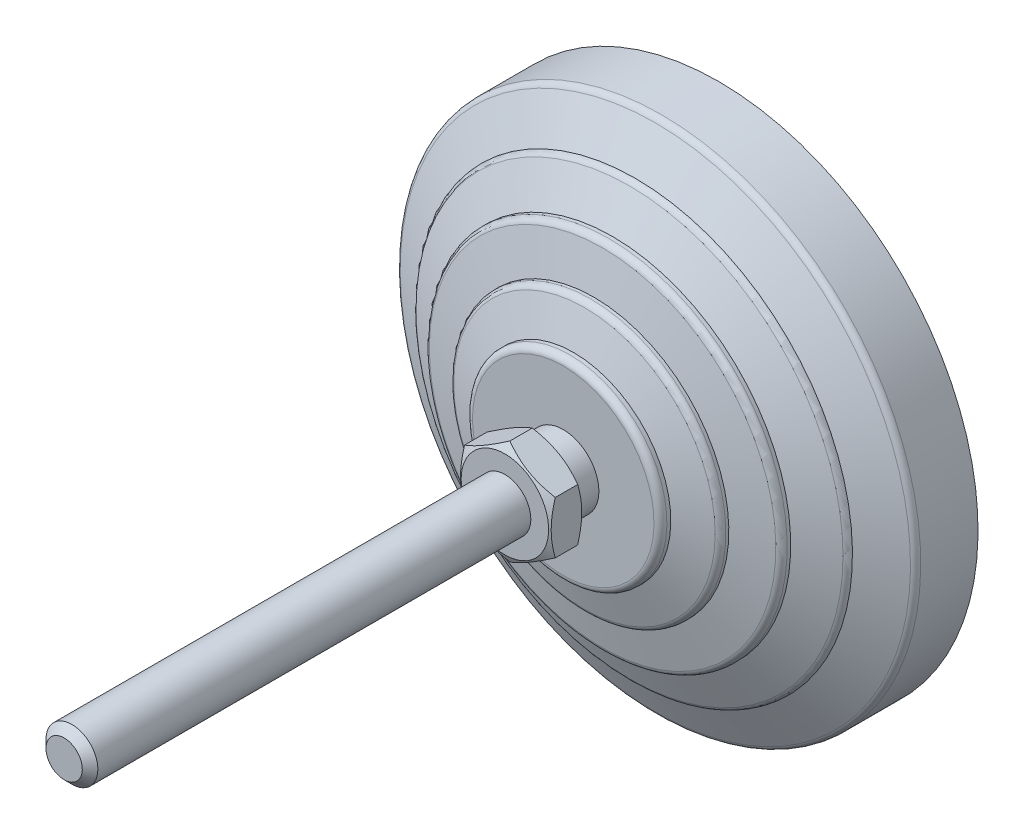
ISO-10303-21;
HEADER;
FILE_DESCRIPTION(('STEP AP214'),'2;1');
FILE_NAME('part.step','',(''),(''),'','','');
FILE_SCHEMA(('AUTOMOTIVE_DESIGN { 1 0 10303 214 1 1 1 1 }'));
ENDSEC;
DATA;
#1=APPLICATION_CONTEXT('core data for automotive mechanical design processes');
#2=APPLICATION_PROTOCOL_DEFINITION('international standard','automotive_design',2000,#1);
#3=PRODUCT_CONTEXT('',#1,'mechanical');
#4=PRODUCT('Part','Part','',(#3));
#5=PRODUCT_RELATED_PRODUCT_CATEGORY('part','',(#4));
#6=PRODUCT_DEFINITION_FORMATION('','',#4);
#7=PRODUCT_DEFINITION_CONTEXT('part definition',#1,'design');
#8=PRODUCT_DEFINITION('design','',#6,#7);
#9=PRODUCT_DEFINITION_SHAPE('','',#8);
#10=(LENGTH_UNIT() NAMED_UNIT(*) SI_UNIT(.MILLI.,.METRE.));
#11=(NAMED_UNIT(*) PLANE_ANGLE_UNIT() SI_UNIT($,.RADIAN.));
#12=(NAMED_UNIT(*) SI_UNIT($,.STERADIAN.) SOLID_ANGLE_UNIT());
#13=UNCERTAINTY_MEASURE_WITH_UNIT(LENGTH_MEASURE(1.E-05),#10,'distance_accuracy_value','');
#14=(GEOMETRIC_REPRESENTATION_CONTEXT(3) GLOBAL_UNCERTAINTY_ASSIGNED_CONTEXT((#13)) GLOBAL_UNIT_ASSIGNED_CONTEXT((#10,
#11,#12)) REPRESENTATION_CONTEXT('',''));
#15=CARTESIAN_POINT('',(0.,0.,0.));
#16=DIRECTION('',(0.,0.,1.));
#17=DIRECTION('',(1.,0.,0.));
#18=AXIS2_PLACEMENT_3D('',#15,#16,#17);
#19=CARTESIAN_POINT('',(-5.49999999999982,0.,28.));
#20=DIRECTION('',(0.,0.,1.));
#21=DIRECTION('',(0.,-1.,0.));
#22=AXIS2_PLACEMENT_3D('',#19,#20,#21);
#23=PLANE('',#22);
#24=CARTESIAN_POINT('',(0.,0.,28.));
#25=DIRECTION('',(0.,0.,-1.));
#26=DIRECTION('',(-1.,0.,0.));
#27=AXIS2_PLACEMENT_3D('',#24,#25,#26);
#28=CIRCLE('',#27,6.75);
#29=CARTESIAN_POINT('',(-6.75,0.,28.));
#30=VERTEX_POINT('',#29);
#31=EDGE_CURVE('E531',#30,#30,#28,.T.);
#32=ORIENTED_EDGE('',*,*,#31,.T.);
#33=EDGE_LOOP('',(#32));
#34=FACE_BOUND('',#33,.T.);
#35=CARTESIAN_POINT('',(0.,0.,28.));
#36=DIRECTION('',(0.,0.,-1.));
#37=DIRECTION('',(0.,1.,0.));
#38=AXIS2_PLACEMENT_3D('',#35,#36,#37);
#39=CIRCLE('',#38,5.49999999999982);
#40=CARTESIAN_POINT('',(0.,5.49999999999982,28.));
#41=VERTEX_POINT('',#40);
#42=EDGE_CURVE('E141',#41,#41,#39,.T.);
#43=ORIENTED_EDGE('',*,*,#42,.F.);
#44=EDGE_LOOP('',(#43));
#45=FACE_BOUND('',#44,.T.);
#46=ADVANCED_FACE('F14',(#34,#45),#23,.F.);
#47=CARTESIAN_POINT('',(0.,0.,0.));
#48=DIRECTION('',(0.,0.,-1.));
#49=DIRECTION('',(0.,1.,0.));
#50=AXIS2_PLACEMENT_3D('',#47,#48,#49);
#51=CYLINDRICAL_SURFACE('',#50,5.49999999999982);
#52=CARTESIAN_POINT('',(0.,0.,24.));
#53=DIRECTION('',(0.,0.,-1.));
#54=DIRECTION('',(0.,1.,0.));
#55=AXIS2_PLACEMENT_3D('',#52,#53,#54);
#56=CIRCLE('',#55,5.49999999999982);
#57=CARTESIAN_POINT('',(0.,5.49999999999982,24.));
#58=VERTEX_POINT('',#57);
#59=EDGE_CURVE('E138',#58,#58,#56,.T.);
#60=ORIENTED_EDGE('',*,*,#59,.F.);
#61=EDGE_LOOP('',(#60));
#62=FACE_BOUND('',#61,.T.);
#63=ORIENTED_EDGE('',*,*,#42,.T.);
#64=EDGE_LOOP('',(#63));
#65=FACE_BOUND('',#64,.T.);
#66=ADVANCED_FACE('F165',(#62,#65),#51,.T.);
#67=CARTESIAN_POINT('',(-5.49999999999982,0.,24.));
#68=DIRECTION('',(0.,0.,-1.));
#69=DIRECTION('',(0.,1.,0.));
#70=AXIS2_PLACEMENT_3D('',#67,#68,#69);
#71=PLANE('',#70);
#72=CARTESIAN_POINT('',(0.,0.,24.));
#73=DIRECTION('',(0.,0.,-1.));
#74=DIRECTION('',(0.,1.,0.));
#75=AXIS2_PLACEMENT_3D('',#72,#73,#74);
#76=CIRCLE('',#75,14.);
#77=CARTESIAN_POINT('',(0.,14.,24.));
#78=VERTEX_POINT('',#77);
#79=EDGE_CURVE('E135',#78,#78,#76,.T.);
#80=ORIENTED_EDGE('',*,*,#79,.F.);
#81=EDGE_LOOP('',(#80));
#82=FACE_BOUND('',#81,.T.);
#83=ORIENTED_EDGE('',*,*,#59,.T.);
#84=EDGE_LOOP('',(#83));
#85=FACE_BOUND('',#84,.T.);
#86=ADVANCED_FACE('F172',(#82,#85),#71,.F.);
#87=CARTESIAN_POINT('',(0.,0.,23.));
#88=DIRECTION('',(0.,0.,-1.));
#89=DIRECTION('',(0.,1.,0.));
#90=AXIS2_PLACEMENT_3D('',#87,#88,#89);
#91=TOROIDAL_SURFACE('',#90,14.,1.);
#92=CARTESIAN_POINT('',(0.,0.,23.));
#93=DIRECTION('',(0.,0.,-1.));
#94=DIRECTION('',(0.,1.,0.));
#95=AXIS2_PLACEMENT_3D('',#92,#93,#94);
#96=CIRCLE('',#95,15.);
#97=CARTESIAN_POINT('',(0.,15.,23.));
#98=VERTEX_POINT('',#97);
#99=EDGE_CURVE('E132',#98,#98,#96,.T.);
#100=ORIENTED_EDGE('',*,*,#99,.F.);
#101=EDGE_LOOP('',(#100));
#102=FACE_BOUND('',#101,.T.);
#103=ORIENTED_EDGE('',*,*,#79,.T.);
#104=EDGE_LOOP('',(#103));
#105=FACE_BOUND('',#104,.T.);
#106=ADVANCED_FACE('F394',(#102,#105),#91,.T.);
#107=CARTESIAN_POINT('',(0.,0.,0.));
#108=DIRECTION('',(0.,0.,-1.));
#109=DIRECTION('',(0.,1.,0.));
#110=AXIS2_PLACEMENT_3D('',#107,#108,#109);
#111=CYLINDRICAL_SURFACE('',#110,15.);
#112=CARTESIAN_POINT('',(0.,0.,22.4025287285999));
#113=DIRECTION('',(0.,0.,-1.));
#114=DIRECTION('',(0.,1.,0.));
#115=AXIS2_PLACEMENT_3D('',#112,#113,#114);
#116=CIRCLE('',#115,15.);
#117=CARTESIAN_POINT('',(0.,15.,22.4025287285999));
#118=VERTEX_POINT('',#117);
#119=EDGE_CURVE('E129',#118,#118,#116,.T.);
#120=ORIENTED_EDGE('',*,*,#119,.F.);
#121=EDGE_LOOP('',(#120));
#122=FACE_BOUND('',#121,.T.);
#123=ORIENTED_EDGE('',*,*,#99,.T.);
#124=EDGE_LOOP('',(#123));
#125=FACE_BOUND('',#124,.T.);
#126=ADVANCED_FACE('F384',(#122,#125),#111,.T.);
#127=CARTESIAN_POINT('',(0.,0.,22.4025287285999));
#128=DIRECTION('',(0.,0.,-1.));
#129=DIRECTION('',(0.,1.,0.));
#130=AXIS2_PLACEMENT_3D('',#127,#128,#129);
#131=CONICAL_SURFACE('',#130,15.,1.25589726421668);
#132=CARTESIAN_POINT('',(0.,0.,20.7216684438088));
#133=DIRECTION('',(0.,0.,-1.));
#134=DIRECTION('',(0.,1.,0.));
#135=AXIS2_PLACEMENT_3D('',#132,#133,#134);
#136=CIRCLE('',#135,20.16016354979);
#137=CARTESIAN_POINT('',(0.,20.16016354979,20.7216684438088));
#138=VERTEX_POINT('',#137);
#139=EDGE_CURVE('E126',#138,#138,#136,.T.);
#140=ORIENTED_EDGE('',*,*,#139,.F.);
#141=EDGE_LOOP('',(#140));
#142=FACE_BOUND('',#141,.T.);
#143=ORIENTED_EDGE('',*,*,#119,.T.);
#144=EDGE_LOOP('',(#143));
#145=FACE_BOUND('',#144,.T.);
#146=ADVANCED_FACE('F374',(#142,#145),#131,.T.);
#147=CARTESIAN_POINT('',(0.,0.,19.7708407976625));
#148=DIRECTION('',(0.,0.,-1.));
#149=DIRECTION('',(0.,1.,0.));
#150=AXIS2_PLACEMENT_3D('',#147,#148,#149);
#151=TOROIDAL_SURFACE('',#150,19.8504430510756,1.);
#152=CARTESIAN_POINT('',(0.,0.,19.7708407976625));
#153=DIRECTION('',(0.,0.,-1.));
#154=DIRECTION('',(0.,1.,0.));
#155=AXIS2_PLACEMENT_3D('',#152,#153,#154);
#156=CIRCLE('',#155,20.8504430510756);
#157=CARTESIAN_POINT('',(0.,20.8504430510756,19.7708407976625));
#158=VERTEX_POINT('',#157);
#159=EDGE_CURVE('E123',#158,#158,#156,.T.);
#160=ORIENTED_EDGE('',*,*,#159,.F.);
#161=EDGE_LOOP('',(#160));
#162=FACE_BOUND('',#161,.T.);
#163=ORIENTED_EDGE('',*,*,#139,.T.);
#164=EDGE_LOOP('',(#163));
#165=FACE_BOUND('',#164,.T.);
#166=ADVANCED_FACE('F364',(#162,#165),#151,.T.);
#167=CARTESIAN_POINT('',(0.,0.,0.));
#168=DIRECTION('',(0.,0.,-1.));
#169=DIRECTION('',(0.,1.,0.));
#170=AXIS2_PLACEMENT_3D('',#167,#168,#169);
#171=CYLINDRICAL_SURFACE('',#170,20.8504430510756);
#172=CARTESIAN_POINT('',(0.,0.,19.2987385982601));
#173=DIRECTION('',(0.,0.,-1.));
#174=DIRECTION('',(0.,1.,0.));
#175=AXIS2_PLACEMENT_3D('',#172,#173,#174);
#176=CIRCLE('',#175,20.8504430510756);
#177=CARTESIAN_POINT('',(0.,20.8504430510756,19.2987385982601));
#178=VERTEX_POINT('',#177);
#179=EDGE_CURVE('E120',#178,#178,#176,.T.);
#180=ORIENTED_EDGE('',*,*,#179,.F.);
#181=EDGE_LOOP('',(#180));
#182=FACE_BOUND('',#181,.T.);
#183=ORIENTED_EDGE('',*,*,#159,.T.);
#184=EDGE_LOOP('',(#183));
#185=FACE_BOUND('',#184,.T.);
#186=ADVANCED_FACE('F354',(#182,#185),#171,.T.);
#187=CARTESIAN_POINT('',(0.,0.,19.2987385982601));
#188=DIRECTION('',(0.,0.,-1.));
#189=DIRECTION('',(0.,1.,0.));
#190=AXIS2_PLACEMENT_3D('',#187,#188,#189);
#191=CONICAL_SURFACE('',#190,20.8504430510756,1.34067144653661);
#192=CARTESIAN_POINT('',(0.,0.,17.9217501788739));
#193=DIRECTION('',(0.,0.,-1.));
#194=DIRECTION('',(0.,1.,0.));
#195=AXIS2_PLACEMENT_3D('',#192,#193,#194);
#196=CIRCLE('',#195,26.728099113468);
#197=CARTESIAN_POINT('',(0.,26.728099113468,17.9217501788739));
#198=VERTEX_POINT('',#197);
#199=EDGE_CURVE('E117',#198,#198,#196,.T.);
#200=ORIENTED_EDGE('',*,*,#199,.F.);
#201=EDGE_LOOP('',(#200));
#202=FACE_BOUND('',#201,.T.);
#203=ORIENTED_EDGE('',*,*,#179,.T.);
#204=EDGE_LOOP('',(#203));
#205=FACE_BOUND('',#204,.T.);
#206=ADVANCED_FACE('F344',(#202,#205),#191,.T.);
#207=CARTESIAN_POINT('',(0.,0.,16.9481122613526));
#208=DIRECTION('',(0.,0.,-1.));
#209=DIRECTION('',(0.,1.,0.));
#210=AXIS2_PLACEMENT_3D('',#207,#208,#209);
#211=TOROIDAL_SURFACE('',#210,26.5,1.);
#212=CARTESIAN_POINT('',(0.,0.,16.9481122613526));
#213=DIRECTION('',(0.,0.,-1.));
#214=DIRECTION('',(0.,1.,0.));
#215=AXIS2_PLACEMENT_3D('',#212,#213,#214);
#216=CIRCLE('',#215,27.5);
#217=CARTESIAN_POINT('',(0.,27.5,16.9481122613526));
#218=VERTEX_POINT('',#217);
#219=EDGE_CURVE('E114',#218,#218,#216,.T.);
#220=ORIENTED_EDGE('',*,*,#219,.F.);
#221=EDGE_LOOP('',(#220));
#222=FACE_BOUND('',#221,.T.);
#223=ORIENTED_EDGE('',*,*,#199,.T.);
#224=EDGE_LOOP('',(#223));
#225=FACE_BOUND('',#224,.T.);
#226=ADVANCED_FACE('F334',(#222,#225),#211,.T.);
#227=CARTESIAN_POINT('',(0.,0.,0.));
#228=DIRECTION('',(0.,0.,-1.));
#229=DIRECTION('',(0.,1.,0.));
#230=AXIS2_PLACEMENT_3D('',#227,#228,#229);
#231=CYLINDRICAL_SURFACE('',#230,27.5);
#232=CARTESIAN_POINT('',(0.,0.,16.4025287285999));
#233=DIRECTION('',(0.,0.,-1.));
#234=DIRECTION('',(0.,1.,0.));
#235=AXIS2_PLACEMENT_3D('',#232,#233,#234);
#236=CIRCLE('',#235,27.5);
#237=CARTESIAN_POINT('',(0.,27.5,16.4025287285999));
#238=VERTEX_POINT('',#237);
#239=EDGE_CURVE('E111',#238,#238,#236,.T.);
#240=ORIENTED_EDGE('',*,*,#239,.F.);
#241=EDGE_LOOP('',(#240));
#242=FACE_BOUND('',#241,.T.);
#243=ORIENTED_EDGE('',*,*,#219,.T.);
#244=EDGE_LOOP('',(#243));
#245=FACE_BOUND('',#244,.T.);
#246=ADVANCED_FACE('F324',(#242,#245),#231,.T.);
#247=CARTESIAN_POINT('',(0.,0.,16.4025287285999));
#248=DIRECTION('',(0.,0.,-1.));
#249=DIRECTION('',(0.,1.,0.));
#250=AXIS2_PLACEMENT_3D('',#247,#248,#249);
#251=CONICAL_SURFACE('',#250,27.5,1.12022914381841);
#252=CARTESIAN_POINT('',(0.,0.,13.7730910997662));
#253=DIRECTION('',(0.,0.,-1.));
#254=DIRECTION('',(0.,1.,0.));
#255=AXIS2_PLACEMENT_3D('',#252,#253,#254);
#256=CIRCLE('',#255,32.935476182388);
#257=CARTESIAN_POINT('',(0.,32.935476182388,13.7730910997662));
#258=VERTEX_POINT('',#257);
#259=EDGE_CURVE('E108',#258,#258,#256,.T.);
#260=ORIENTED_EDGE('',*,*,#259,.F.);
#261=EDGE_LOOP('',(#260));
#262=FACE_BOUND('',#261,.T.);
#263=ORIENTED_EDGE('',*,*,#239,.T.);
#264=EDGE_LOOP('',(#263));
#265=FACE_BOUND('',#264,.T.);
#266=ADVANCED_FACE('F314',(#262,#265),#251,.T.);
#267=CARTESIAN_POINT('',(0.,0.,12.872890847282));
#268=DIRECTION('',(0.,0.,-1.));
#269=DIRECTION('',(0.,1.,0.));
#270=AXIS2_PLACEMENT_3D('',#267,#268,#269);
#271=TOROIDAL_SURFACE('',#270,32.5,1.);
#272=CARTESIAN_POINT('',(0.,0.,12.872890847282));
#273=DIRECTION('',(0.,0.,-1.));
#274=DIRECTION('',(0.,1.,0.));
#275=AXIS2_PLACEMENT_3D('',#272,#273,#274);
#276=CIRCLE('',#275,33.5);
#277=CARTESIAN_POINT('',(0.,33.5,12.872890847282));
#278=VERTEX_POINT('',#277);
#279=EDGE_CURVE('E105',#278,#278,#276,.T.);
#280=ORIENTED_EDGE('',*,*,#279,.F.);
#281=EDGE_LOOP('',(#280));
#282=FACE_BOUND('',#281,.T.);
#283=ORIENTED_EDGE('',*,*,#259,.T.);
#284=EDGE_LOOP('',(#283));
#285=FACE_BOUND('',#284,.T.);
#286=ADVANCED_FACE('F304',(#282,#285),#271,.T.);
#287=CARTESIAN_POINT('',(0.,0.,12.872890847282));
#288=DIRECTION('',(0.,0.,-1.));
#289=DIRECTION('',(0.,1.,0.));
#290=AXIS2_PLACEMENT_3D('',#287,#288,#289);
#291=CONICAL_SURFACE('',#290,33.5,1.08482699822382);
#292=CARTESIAN_POINT('',(0.,0.,9.7780502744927));
#293=DIRECTION('',(0.,0.,-1.));
#294=DIRECTION('',(0.,1.,0.));
#295=AXIS2_PLACEMENT_3D('',#292,#293,#294);
#296=CIRCLE('',#295,39.358979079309);
#297=CARTESIAN_POINT('',(0.,39.358979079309,9.7780502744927));
#298=VERTEX_POINT('',#297);
#299=EDGE_CURVE('E102',#298,#298,#296,.T.);
#300=ORIENTED_EDGE('',*,*,#299,.F.);
#301=EDGE_LOOP('',(#300));
#302=FACE_BOUND('',#301,.T.);
#303=ORIENTED_EDGE('',*,*,#279,.T.);
#304=EDGE_LOOP('',(#303));
#305=FACE_BOUND('',#304,.T.);
#306=ADVANCED_FACE('F294',(#302,#305),#291,.T.);
#307=CARTESIAN_POINT('',(0.,0.,8.84470466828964));
#308=DIRECTION('',(0.,0.,-1.));
#309=DIRECTION('',(0.,1.,0.));
#310=AXIS2_PLACEMENT_3D('',#307,#308,#309);
#311=TOROIDAL_SURFACE('',#310,39.,1.);
#312=CARTESIAN_POINT('',(0.,0.,8.84470466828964));
#313=DIRECTION('',(0.,0.,-1.));
#314=DIRECTION('',(0.,1.,0.));
#315=AXIS2_PLACEMENT_3D('',#312,#313,#314);
#316=CIRCLE('',#315,40.);
#317=CARTESIAN_POINT('',(0.,40.,8.84470466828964));
#318=VERTEX_POINT('',#317);
#319=EDGE_CURVE('E99',#318,#318,#316,.T.);
#320=ORIENTED_EDGE('',*,*,#319,.F.);
#321=EDGE_LOOP('',(#320));
#322=FACE_BOUND('',#321,.T.);
#323=ORIENTED_EDGE('',*,*,#299,.T.);
#324=EDGE_LOOP('',(#323));
#325=FACE_BOUND('',#324,.T.);
#326=ADVANCED_FACE('F284',(#322,#325),#311,.T.);
#327=CARTESIAN_POINT('',(0.,0.,0.));
#328=DIRECTION('',(0.,0.,-1.));
#329=DIRECTION('',(0.,1.,0.));
#330=AXIS2_PLACEMENT_3D('',#327,#328,#329);
#331=CYLINDRICAL_SURFACE('',#330,40.);
#332=CARTESIAN_POINT('',(0.,0.,0.));
#333=DIRECTION('',(0.,0.,-1.));
#334=DIRECTION('',(0.,1.,0.));
#335=AXIS2_PLACEMENT_3D('',#332,#333,#334);
#336=CIRCLE('',#335,40.);
#337=CARTESIAN_POINT('',(0.,40.,0.));
#338=VERTEX_POINT('',#337);
#339=EDGE_CURVE('E96',#338,#338,#336,.T.);
#340=ORIENTED_EDGE('',*,*,#339,.F.);
#341=EDGE_LOOP('',(#340));
#342=FACE_BOUND('',#341,.T.);
#343=ORIENTED_EDGE('',*,*,#319,.T.);
#344=EDGE_LOOP('',(#343));
#345=FACE_BOUND('',#344,.T.);
#346=ADVANCED_FACE('F273',(#342,#345),#331,.T.);
#347=CARTESIAN_POINT('',(0.,0.,0.));
#348=DIRECTION('',(0.,0.,1.));
#349=DIRECTION('',(0.,-1.,0.));
#350=AXIS2_PLACEMENT_3D('',#347,#348,#349);
#351=PLANE('',#350);
#352=ORIENTED_EDGE('',*,*,#339,.T.);
#353=EDGE_LOOP('',(#352));
#354=FACE_BOUND('',#353,.T.);
#355=ADVANCED_FACE('F163',(#354),#351,.F.);
#356=CARTESIAN_POINT('',(0.,0.,29.5002734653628));
#357=DIRECTION('',(0.,0.,1.));
#358=DIRECTION('',(1.,0.,0.));
#359=AXIS2_PLACEMENT_3D('',#356,#357,#358);
#360=CONICAL_SURFACE('',#359,9.3485498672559,1.0471975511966);
#361=CARTESIAN_POINT('',(0.000200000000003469,-8.0830192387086,28.7696190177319));
#362=CARTESIAN_POINT('',(-0.15366790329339,-7.99418356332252,28.7183374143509));
#363=CARTESIAN_POINT('',(-0.308109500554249,-7.90501666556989,28.669383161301));
#364=CARTESIAN_POINT('',(-0.618246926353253,-7.72595873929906,28.5767703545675));
#365=CARTESIAN_POINT('',(-0.773943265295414,-7.63606741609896,28.5331140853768));
#366=CARTESIAN_POINT('',(-1.24352516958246,-7.36495417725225,28.4109491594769));
#367=CARTESIAN_POINT('',(-1.5592643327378,-7.18266208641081,28.3414631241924));
#368=CARTESIAN_POINT('',(-2.03176224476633,-6.90986528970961,28.2599825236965));
#369=CARTESIAN_POINT('',(-2.18710922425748,-6.82017566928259,28.2367710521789));
#370=CARTESIAN_POINT('',(-2.49850511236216,-6.64039116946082,28.1978487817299));
#371=CARTESIAN_POINT('',(-2.6545539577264,-6.55029632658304,28.1821373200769));
#372=CARTESIAN_POINT('',(-2.96692267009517,-6.36995016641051,28.1586154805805));
#373=CARTESIAN_POINT('',(-3.12324202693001,-6.27969914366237,28.1507961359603));
#374=CARTESIAN_POINT('',(-3.43601650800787,-6.09911871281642,28.1432178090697));
#375=CARTESIAN_POINT('',(-3.59247162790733,-6.00878930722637,28.1434585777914));
#376=CARTESIAN_POINT('',(-4.02110687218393,-5.76131663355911,28.155197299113));
#377=CARTESIAN_POINT('',(-4.29314668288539,-5.60425437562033,28.1749033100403));
#378=CARTESIAN_POINT('',(-4.83541944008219,-5.29117305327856,28.2373910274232));
#379=CARTESIAN_POINT('',(-5.10565047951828,-5.13515508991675,28.2801940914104));
#380=CARTESIAN_POINT('',(-5.64901454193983,-4.82144370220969,28.3871892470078));
#381=CARTESIAN_POINT('',(-5.92207900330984,-4.6637898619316,28.4518346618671));
#382=CARTESIAN_POINT('',(-6.46413578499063,-4.35083323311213,28.5985536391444));
#383=CARTESIAN_POINT('',(-6.73313504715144,-4.19552643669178,28.680592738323));
#384=CARTESIAN_POINT('',(-7.0002,-4.04133641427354,28.7696190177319));
#385=B_SPLINE_CURVE_WITH_KNOTS('',3,(#361,#362,#363,#364,#365,#366,#367,#368,#369,#370,#371,
#372,#373,#374,#375,#376,#377,#378,#379,#380,#381,#382,#383,#384),.UNSPECIFIED.,.F.,.F.,(4,2,2,
2,2,2,2,2,2,2,2,4),(0.,0.554727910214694,1.10969417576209,2.2219327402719,2.76443041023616,
3.30688013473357,3.84871284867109,4.39052882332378,5.33376515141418,6.27787517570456,
7.2429241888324,8.20607866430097),.UNSPECIFIED.);
#386=CARTESIAN_POINT('',(0.,-8.08290376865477,28.7695523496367));
#387=VERTEX_POINT('',#386);
#388=CARTESIAN_POINT('',(-7.,-4.04145188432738,28.7695523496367));
#389=VERTEX_POINT('',#388);
#390=EDGE_CURVE('E73',#387,#389,#385,.T.);
#391=ORIENTED_EDGE('',*,*,#390,.T.);
#392=CARTESIAN_POINT('',(-7.,-10.8000725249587,31.5334883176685));
#393=CARTESIAN_POINT('',(-7.,-10.4947981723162,31.3856279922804));
#394=CARTESIAN_POINT('',(-7.,-10.1888170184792,31.2392016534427));
#395=CARTESIAN_POINT('',(-7.,-9.57506499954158,30.9500246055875));
#396=CARTESIAN_POINT('',(-7.,-9.26729385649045,30.8072744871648));
#397=CARTESIAN_POINT('',(-7.,-8.6479731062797,30.525527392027));
#398=CARTESIAN_POINT('',(-7.,-8.33641201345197,30.3865555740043));
#399=CARTESIAN_POINT('',(-7.,-7.7107921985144,30.1143742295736));
#400=CARTESIAN_POINT('',(-7.,-7.39673359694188,29.9811644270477));
#401=CARTESIAN_POINT('',(-7.,-6.7557024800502,29.7179585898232));
#402=CARTESIAN_POINT('',(-7.,-6.42863408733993,29.5881947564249));
#403=CARTESIAN_POINT('',(-7.,-5.77065108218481,29.3386238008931));
#404=CARTESIAN_POINT('',(-7.,-5.4397360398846,29.2188178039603));
#405=CARTESIAN_POINT('',(-7.,-4.77416687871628,28.9923489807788));
#406=CARTESIAN_POINT('',(-7.,-4.43952208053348,28.8856590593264));
#407=CARTESIAN_POINT('',(-7.,-3.765444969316,28.6888810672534));
#408=CARTESIAN_POINT('',(-7.,-3.42601421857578,28.5987877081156));
#409=CARTESIAN_POINT('',(-7.,-2.74398709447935,28.4400448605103));
#410=CARTESIAN_POINT('',(-7.,-2.40141801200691,28.3712813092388));
#411=CARTESIAN_POINT('',(-7.,-1.88448997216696,28.2871384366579));
#412=CARTESIAN_POINT('',(-7.,-1.7116551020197,28.2622567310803));
#413=CARTESIAN_POINT('',(-7.,-1.36514538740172,28.2193167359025));
#414=CARTESIAN_POINT('',(-7.,-1.19147062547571,28.2012577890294));
#415=CARTESIAN_POINT('',(-7.,-0.845758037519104,28.1725467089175));
#416=CARTESIAN_POINT('',(-7.,-0.673727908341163,28.161802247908));
#417=CARTESIAN_POINT('',(-7.,-0.329367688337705,28.1475938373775));
#418=CARTESIAN_POINT('',(-7.,-0.157037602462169,28.1441297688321));
#419=CARTESIAN_POINT('',(-7.,0.187615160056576,28.1445646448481));
#420=CARTESIAN_POINT('',(-7.,0.35993783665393,28.1484636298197));
#421=CARTESIAN_POINT('',(-7.,0.704267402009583,28.163530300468));
#422=CARTESIAN_POINT('',(-7.,0.876274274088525,28.1746983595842));
#423=CARTESIAN_POINT('',(-7.,1.29136456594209,28.2101860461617));
#424=CARTESIAN_POINT('',(-7.,1.5341512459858,28.2380492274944));
#425=CARTESIAN_POINT('',(-7.,2.01787436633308,28.3067245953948));
#426=CARTESIAN_POINT('',(-7.,2.25881054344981,28.3475385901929));
#427=CARTESIAN_POINT('',(-7.,2.97859497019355,28.4872384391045));
#428=CARTESIAN_POINT('',(-7.,3.4541404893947,28.6033552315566));
#429=CARTESIAN_POINT('',(-7.,4.16513621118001,28.8041034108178));
#430=CARTESIAN_POINT('',(-7.,4.40428948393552,28.8763686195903));
#431=CARTESIAN_POINT('',(-7.,4.88027219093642,29.0282529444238));
#432=CARTESIAN_POINT('',(-7.,5.1171016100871,29.1078721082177));
#433=CARTESIAN_POINT('',(-7.,5.58851407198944,29.2731995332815));
#434=CARTESIAN_POINT('',(-7.,5.82309786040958,29.3589056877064));
#435=CARTESIAN_POINT('',(-7.,6.29033210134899,29.5354138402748));
#436=CARTESIAN_POINT('',(-7.,6.52298257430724,29.6262157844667));
#437=CARTESIAN_POINT('',(-7.,7.0628659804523,29.842655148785));
#438=CARTESIAN_POINT('',(-7.,7.36944444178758,29.9699218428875));
#439=CARTESIAN_POINT('',(-7.,7.98007301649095,30.2303994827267));
#440=CARTESIAN_POINT('',(-7.,8.28412298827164,30.3636107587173));
#441=CARTESIAN_POINT('',(-7.,8.89014777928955,30.6348092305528));
#442=CARTESIAN_POINT('',(-7.,9.19212220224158,30.7727973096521));
#443=CARTESIAN_POINT('',(-7.,9.79428929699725,31.0526145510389));
#444=CARTESIAN_POINT('',(-7.,10.0944819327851,31.1944437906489));
#445=CARTESIAN_POINT('',(-7.,10.6936664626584,31.4813784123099));
#446=CARTESIAN_POINT('',(-7.,10.9926568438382,31.6264869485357));
#447=CARTESIAN_POINT('',(-7.,11.5893671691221,31.9192953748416));
#448=CARTESIAN_POINT('',(-7.,11.8870871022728,32.0669952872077));
#449=CARTESIAN_POINT('',(-7.,12.7785655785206,32.5132694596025));
#450=CARTESIAN_POINT('',(-7.,13.3707169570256,32.8150539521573));
#451=CARTESIAN_POINT('',(-7.,14.5038839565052,33.3999081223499));
#452=CARTESIAN_POINT('',(-7.,15.0451443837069,33.6825055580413));
#453=CARTESIAN_POINT('',(-7.,16.1256470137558,34.2515723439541));
#454=CARTESIAN_POINT('',(-7.,16.6648891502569,34.5380418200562));
#455=CARTESIAN_POINT('',(-7.,17.7405205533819,35.1132591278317));
#456=CARTESIAN_POINT('',(-7.,18.2769135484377,35.4019999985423));
#457=CARTESIAN_POINT('',(-7.,19.3484037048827,35.9818105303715));
#458=CARTESIAN_POINT('',(-7.,19.883500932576,36.2728800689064));
#459=CARTESIAN_POINT('',(-7.,20.4181185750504,36.5648219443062));
#460=B_SPLINE_CURVE_WITH_KNOTS('',3,(#392,#393,#394,#395,#396,#397,#398,#399,#400,#401,#402,
#403,#404,#405,#406,#407,#408,#409,#410,#411,#412,#413,#414,#415,#416,#417,#418,#419,#420,#421,
#422,#423,#424,#425,#426,#427,#428,#429,#430,#431,#432,#433,#434,#435,#436,#437,#438,#439,#440,
#441,#442,#443,#444,#445,#446,#447,#448,#449,#450,#451,#452,#453,#454,#455,#456,#457,#458,#459),
.UNSPECIFIED.,.F.,.F.,(4,2,2,2,2,2,2,2,2,2,2,2,2,2,2,2,2,2,2,2,2,2,2,2,2,2,2,2,2,2,2,2,2,4),(0.,
1.01760591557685,2.0353743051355,3.05877828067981,4.08213315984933,5.13761691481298,
6.19321977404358,7.24660395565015,8.29965189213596,9.34696742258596,9.8707040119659,
10.3943901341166,10.9113369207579,11.4282752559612,11.9452164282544,12.462184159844,
13.1949098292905,13.9277378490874,15.3942299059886,16.1436684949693,16.8931119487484,
17.6422972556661,18.3914746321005,19.3872246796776,20.3830301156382,21.3790206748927,
22.3750312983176,23.3720445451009,24.3690663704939,26.362863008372,28.1946261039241,
30.0264488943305,31.8539543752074,33.6813642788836),.UNSPECIFIED.);
#461=CARTESIAN_POINT('',(-7.,4.04145188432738,28.7695523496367));
#462=VERTEX_POINT('',#461);
#463=EDGE_CURVE('E81',#389,#462,#460,.T.);
#464=ORIENTED_EDGE('',*,*,#463,.T.);
#465=CARTESIAN_POINT('',(-7.0002,4.04133641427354,28.7696190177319));
#466=CARTESIAN_POINT('',(-6.84633209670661,4.13017208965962,28.7183374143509));
#467=CARTESIAN_POINT('',(-6.69189049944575,4.21933898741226,28.669383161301));
#468=CARTESIAN_POINT('',(-6.38175307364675,4.39839691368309,28.5767703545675));
#469=CARTESIAN_POINT('',(-6.22605673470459,4.48828823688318,28.5331140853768));
#470=CARTESIAN_POINT('',(-5.75647483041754,4.75940147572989,28.4109491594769));
#471=CARTESIAN_POINT('',(-5.4407356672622,4.94169356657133,28.3414631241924));
#472=CARTESIAN_POINT('',(-4.96823775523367,5.21449036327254,28.2599825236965));
#473=CARTESIAN_POINT('',(-4.81289077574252,5.30417998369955,28.2367710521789));
#474=CARTESIAN_POINT('',(-4.50149488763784,5.48396448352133,28.1978487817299));
#475=CARTESIAN_POINT('',(-4.34544604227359,5.57405932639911,28.1821373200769));
#476=CARTESIAN_POINT('',(-4.03307732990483,5.75440548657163,28.1586154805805));
#477=CARTESIAN_POINT('',(-3.87675797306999,5.84465650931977,28.1507961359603));
#478=CARTESIAN_POINT('',(-3.56398349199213,6.02523694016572,28.1432178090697));
#479=CARTESIAN_POINT('',(-3.40752837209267,6.11556634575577,28.1434585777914));
#480=CARTESIAN_POINT('',(-2.97889312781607,6.36303901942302,28.155197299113));
#481=CARTESIAN_POINT('',(-2.7068533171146,6.52010127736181,28.1749033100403));
#482=CARTESIAN_POINT('',(-2.16458055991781,6.83318259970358,28.2373910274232));
#483=CARTESIAN_POINT('',(-1.89434952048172,6.9892005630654,28.2801940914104));
#484=CARTESIAN_POINT('',(-1.35098545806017,7.30291195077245,28.3871892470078));
#485=CARTESIAN_POINT('',(-1.07792099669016,7.46056579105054,28.4518346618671));
#486=CARTESIAN_POINT('',(-0.535864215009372,7.77352241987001,28.5985536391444));
#487=CARTESIAN_POINT('',(-0.266864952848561,7.92882921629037,28.680592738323));
#488=CARTESIAN_POINT('',(0.000199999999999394,8.0830192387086,28.7696190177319));
#489=B_SPLINE_CURVE_WITH_KNOTS('',3,(#465,#466,#467,#468,#469,#470,#471,#472,#473,#474,#475,
#476,#477,#478,#479,#480,#481,#482,#483,#484,#485,#486,#487,#488),.UNSPECIFIED.,.F.,.F.,(4,2,2,
2,2,2,2,2,2,2,2,4),(0.,0.554727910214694,1.10969417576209,2.2219327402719,2.76443041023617,
3.30688013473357,3.84871284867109,4.39052882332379,5.33376515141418,6.27787517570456,
7.2429241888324,8.20607866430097),.UNSPECIFIED.);
#490=CARTESIAN_POINT('',(0.,8.08290376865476,28.7695523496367));
#491=VERTEX_POINT('',#490);
#492=EDGE_CURVE('E486',#462,#491,#489,.T.);
#493=ORIENTED_EDGE('',*,*,#492,.T.);
#494=CARTESIAN_POINT('',(-0.000200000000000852,8.0830192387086,28.7696190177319));
#495=CARTESIAN_POINT('',(0.15366790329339,7.99418356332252,28.7183374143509));
#496=CARTESIAN_POINT('',(0.308109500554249,7.90501666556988,28.669383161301));
#497=CARTESIAN_POINT('',(0.618246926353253,7.72595873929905,28.5767703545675));
#498=CARTESIAN_POINT('',(0.773943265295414,7.63606741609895,28.5331140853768));
#499=CARTESIAN_POINT('',(1.24352516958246,7.36495417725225,28.4109491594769));
#500=CARTESIAN_POINT('',(1.5592643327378,7.18266208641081,28.3414631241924));
#501=CARTESIAN_POINT('',(2.03176224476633,6.9098652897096,28.2599825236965));
#502=CARTESIAN_POINT('',(2.18710922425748,6.82017566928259,28.2367710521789));
#503=CARTESIAN_POINT('',(2.49850511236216,6.64039116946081,28.1978487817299));
#504=CARTESIAN_POINT('',(2.65455395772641,6.55029632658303,28.1821373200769));
#505=CARTESIAN_POINT('',(2.96692267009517,6.36995016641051,28.1586154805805));
#506=CARTESIAN_POINT('',(3.12324202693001,6.27969914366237,28.1507961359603));
#507=CARTESIAN_POINT('',(3.43601650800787,6.09911871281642,28.1432178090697));
#508=CARTESIAN_POINT('',(3.59247162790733,6.00878930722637,28.1434585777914));
#509=CARTESIAN_POINT('',(4.02110687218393,5.76131663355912,28.155197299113));
#510=CARTESIAN_POINT('',(4.2931466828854,5.60425437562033,28.1749033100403));
#511=CARTESIAN_POINT('',(4.83541944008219,5.29117305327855,28.2373910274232));
#512=CARTESIAN_POINT('',(5.10565047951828,5.13515508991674,28.2801940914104));
#513=CARTESIAN_POINT('',(5.64901454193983,4.82144370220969,28.3871892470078));
#514=CARTESIAN_POINT('',(5.92207900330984,4.66378986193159,28.4518346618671));
#515=CARTESIAN_POINT('',(6.46413578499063,4.35083323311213,28.5985536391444));
#516=CARTESIAN_POINT('',(6.73313504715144,4.19552643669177,28.680592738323));
#517=CARTESIAN_POINT('',(7.0002,4.04133641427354,28.7696190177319));
#518=B_SPLINE_CURVE_WITH_KNOTS('',3,(#494,#495,#496,#497,#498,#499,#500,#501,#502,#503,#504,
#505,#506,#507,#508,#509,#510,#511,#512,#513,#514,#515,#516,#517),.UNSPECIFIED.,.F.,.F.,(4,2,2,
2,2,2,2,2,2,2,2,4),(0.,0.554727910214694,1.10969417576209,2.2219327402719,2.76443041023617,
3.30688013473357,3.8487128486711,4.39052882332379,5.33376515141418,6.27787517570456,
7.2429241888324,8.20607866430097),.UNSPECIFIED.);
#519=CARTESIAN_POINT('',(7.,4.04145188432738,28.7695523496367));
#520=VERTEX_POINT('',#519);
#521=EDGE_CURVE('E481',#491,#520,#518,.T.);
#522=ORIENTED_EDGE('',*,*,#521,.T.);
#523=CARTESIAN_POINT('',(7.,-10.8000725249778,31.5334883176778));
#524=CARTESIAN_POINT('',(7.,-10.4947981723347,31.3856279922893));
#525=CARTESIAN_POINT('',(7.,-10.1888170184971,31.2392016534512));
#526=CARTESIAN_POINT('',(7.,-9.57506499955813,30.9500246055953));
#527=CARTESIAN_POINT('',(7.,-9.26729385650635,30.8072744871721));
#528=CARTESIAN_POINT('',(7.,-8.6479731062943,30.5255273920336));
#529=CARTESIAN_POINT('',(7.,-8.33641201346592,30.3865555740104));
#530=CARTESIAN_POINT('',(7.,-7.71079219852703,30.114374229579));
#531=CARTESIAN_POINT('',(7.,-7.39673359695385,29.9811644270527));
#532=CARTESIAN_POINT('',(7.,-6.7557024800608,29.7179585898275));
#533=CARTESIAN_POINT('',(7.,-6.42863408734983,29.5881947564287));
#534=CARTESIAN_POINT('',(7.,-5.77065108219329,29.3386238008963));
#535=CARTESIAN_POINT('',(7.,-5.43973603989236,29.218817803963));
#536=CARTESIAN_POINT('',(7.,-4.77416687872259,28.9923489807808));
#537=CARTESIAN_POINT('',(7.,-4.43952208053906,28.8856590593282));
#538=CARTESIAN_POINT('',(7.,-3.76544496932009,28.6888810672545));
#539=CARTESIAN_POINT('',(7.,-3.42601421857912,28.5987877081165));
#540=CARTESIAN_POINT('',(7.,-2.74398709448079,28.4400448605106));
#541=CARTESIAN_POINT('',(7.,-2.40141801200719,28.3712813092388));
#542=CARTESIAN_POINT('',(7.,-1.8844899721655,28.2871384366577));
#543=CARTESIAN_POINT('',(7.,-1.71165510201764,28.26225673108));
#544=CARTESIAN_POINT('',(7.,-1.36514538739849,28.2193167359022));
#545=CARTESIAN_POINT('',(7.,-1.19147062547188,28.201257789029));
#546=CARTESIAN_POINT('',(7.,-0.845758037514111,28.1725467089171));
#547=CARTESIAN_POINT('',(7.,-0.673727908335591,28.1618022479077));
#548=CARTESIAN_POINT('',(7.,-0.329367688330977,28.1475938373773));
#549=CARTESIAN_POINT('',(7.,-0.157037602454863,28.144129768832));
#550=CARTESIAN_POINT('',(7.,0.187615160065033,28.1445646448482));
#551=CARTESIAN_POINT('',(7.,0.359937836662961,28.14846362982));
#552=CARTESIAN_POINT('',(7.,0.704267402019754,28.1635303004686));
#553=CARTESIAN_POINT('',(7.,0.87627427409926,28.174698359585));
#554=CARTESIAN_POINT('',(7.,1.29136456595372,28.2101860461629));
#555=CARTESIAN_POINT('',(7.,1.53415124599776,28.2380492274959));
#556=CARTESIAN_POINT('',(7.,2.01787436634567,28.3067245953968));
#557=CARTESIAN_POINT('',(7.,2.25881054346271,28.3475385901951));
#558=CARTESIAN_POINT('',(7.,2.97859497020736,28.4872384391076));
#559=CARTESIAN_POINT('',(7.,3.45414048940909,28.6033552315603));
#560=CARTESIAN_POINT('',(7.,4.16513621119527,28.8041034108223));
#561=CARTESIAN_POINT('',(7.,4.40428948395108,28.8763686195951));
#562=CARTESIAN_POINT('',(7.,4.88027219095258,29.0282529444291));
#563=CARTESIAN_POINT('',(7.,5.11710161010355,29.1078721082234));
#564=CARTESIAN_POINT('',(7.,5.58851407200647,29.2731995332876));
#565=CARTESIAN_POINT('',(7.,5.82309786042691,29.3589056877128));
#566=CARTESIAN_POINT('',(7.,6.2903321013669,29.5354138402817));
#567=CARTESIAN_POINT('',(7.,6.52298257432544,29.6262157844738));
#568=CARTESIAN_POINT('',(7.,7.0628659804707,29.8426551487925));
#569=CARTESIAN_POINT('',(7.,7.3694444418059,29.9699218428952));
#570=CARTESIAN_POINT('',(7.,7.98007301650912,30.2303994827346));
#571=CARTESIAN_POINT('',(7.,8.28412298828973,30.3636107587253));
#572=CARTESIAN_POINT('',(7.,8.8901477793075,30.6348092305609));
#573=CARTESIAN_POINT('',(7.,9.19212220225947,30.7727973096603));
#574=CARTESIAN_POINT('',(7.,9.79428929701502,31.0526145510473));
#575=CARTESIAN_POINT('',(7.,10.0944819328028,31.1944437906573));
#576=CARTESIAN_POINT('',(7.,10.6936664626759,31.4813784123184));
#577=CARTESIAN_POINT('',(7.,10.9926568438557,31.6264869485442));
#578=CARTESIAN_POINT('',(7.,11.5893671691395,31.9192953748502));
#579=CARTESIAN_POINT('',(7.,11.8870871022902,32.0669952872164));
#580=CARTESIAN_POINT('',(7.,12.7785655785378,32.5132694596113));
#581=CARTESIAN_POINT('',(7.,13.3707169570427,32.8150539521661));
#582=CARTESIAN_POINT('',(7.,14.5038839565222,33.3999081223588));
#583=CARTESIAN_POINT('',(7.,15.0451443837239,33.6825055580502));
#584=CARTESIAN_POINT('',(7.,16.1256470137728,34.2515723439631));
#585=CARTESIAN_POINT('',(7.,16.6648891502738,34.5380418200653));
#586=CARTESIAN_POINT('',(7.,17.7405205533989,35.1132591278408));
#587=CARTESIAN_POINT('',(7.,18.2769135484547,35.4019999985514));
#588=CARTESIAN_POINT('',(7.,19.3484037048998,35.9818105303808));
#589=CARTESIAN_POINT('',(7.,19.883500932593,36.2728800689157));
#590=CARTESIAN_POINT('',(7.,20.4181185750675,36.5648219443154));
#591=B_SPLINE_CURVE_WITH_KNOTS('',3,(#523,#524,#525,#526,#527,#528,#529,#530,#531,#532,#533,
#534,#535,#536,#537,#538,#539,#540,#541,#542,#543,#544,#545,#546,#547,#548,#549,#550,#551,#552,
#553,#554,#555,#556,#557,#558,#559,#560,#561,#562,#563,#564,#565,#566,#567,#568,#569,#570,#571,
#572,#573,#574,#575,#576,#577,#578,#579,#580,#581,#582,#583,#584,#585,#586,#587,#588,#589,#590),
.UNSPECIFIED.,.F.,.F.,(4,2,2,2,2,2,2,2,2,2,2,2,2,2,2,2,2,2,2,2,2,2,2,2,2,2,2,2,2,2,2,2,2,4),(0.,
1.0176059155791,2.03537430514,3.05877828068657,4.08213315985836,5.13761691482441,
6.19321977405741,7.24660395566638,8.29965189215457,9.34696742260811,9.87070401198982,
10.3943901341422,10.9113369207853,11.4282752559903,11.9452164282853,12.4621841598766,
13.1949098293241,13.9277378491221,15.3942299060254,16.1436684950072,16.8931119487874,
17.6422972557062,18.3914746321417,19.3872246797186,20.3830301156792,21.3790206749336,
22.3750312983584,23.3720445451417,24.3690663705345,26.3628630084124,28.1946261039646,
30.026448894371,31.853954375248,33.6813642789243),.UNSPECIFIED.);
#592=CARTESIAN_POINT('',(7.,-4.04145188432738,28.7695523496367));
#593=VERTEX_POINT('',#592);
#594=EDGE_CURVE('E34',#520,#593,#591,.F.);
#595=ORIENTED_EDGE('',*,*,#594,.T.);
#596=CARTESIAN_POINT('',(7.0002,-4.04133641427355,28.7696190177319));
#597=CARTESIAN_POINT('',(6.84633209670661,-4.13017208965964,28.7183374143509));
#598=CARTESIAN_POINT('',(6.69189049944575,-4.21933898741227,28.669383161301));
#599=CARTESIAN_POINT('',(6.38175307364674,-4.3983969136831,28.5767703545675));
#600=CARTESIAN_POINT('',(6.22605673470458,-4.4882882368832,28.5331140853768));
#601=CARTESIAN_POINT('',(5.75647483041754,-4.7594014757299,28.4109491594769));
#602=CARTESIAN_POINT('',(5.4407356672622,-4.94169356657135,28.3414631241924));
#603=CARTESIAN_POINT('',(4.96823775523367,-5.21449036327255,28.2599825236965));
#604=CARTESIAN_POINT('',(4.81289077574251,-5.30417998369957,28.2367710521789));
#605=CARTESIAN_POINT('',(4.50149488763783,-5.48396448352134,28.1978487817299));
#606=CARTESIAN_POINT('',(4.34544604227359,-5.57405932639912,28.1821373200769));
#607=CARTESIAN_POINT('',(4.03307732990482,-5.75440548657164,28.1586154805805));
#608=CARTESIAN_POINT('',(3.87675797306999,-5.84465650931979,28.1507961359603));
#609=CARTESIAN_POINT('',(3.56398349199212,-6.02523694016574,28.1432178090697));
#610=CARTESIAN_POINT('',(3.40752837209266,-6.11556634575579,28.1434585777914));
#611=CARTESIAN_POINT('',(2.97889312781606,-6.36303901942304,28.155197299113));
#612=CARTESIAN_POINT('',(2.7068533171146,-6.52010127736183,28.1749033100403));
#613=CARTESIAN_POINT('',(2.1645805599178,-6.8331825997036,28.2373910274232));
#614=CARTESIAN_POINT('',(1.89434952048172,-6.98920056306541,28.2801940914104));
#615=CARTESIAN_POINT('',(1.35098545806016,-7.30291195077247,28.3871892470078));
#616=CARTESIAN_POINT('',(1.07792099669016,-7.46056579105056,28.4518346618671));
#617=CARTESIAN_POINT('',(0.535864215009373,-7.77352241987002,28.5985536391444));
#618=CARTESIAN_POINT('',(0.266864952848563,-7.92882921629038,28.680592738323));
#619=CARTESIAN_POINT('',(-0.000199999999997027,-8.08301923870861,28.7696190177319));
#620=B_SPLINE_CURVE_WITH_KNOTS('',3,(#596,#597,#598,#599,#600,#601,#602,#603,#604,#605,#606,
#607,#608,#609,#610,#611,#612,#613,#614,#615,#616,#617,#618,#619),.UNSPECIFIED.,.F.,.F.,(4,2,2,
2,2,2,2,2,2,2,2,4),(0.,0.554727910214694,1.10969417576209,2.2219327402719,2.76443041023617,
3.30688013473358,3.8487128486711,4.39052882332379,5.33376515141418,6.27787517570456,
7.24292418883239,8.20607866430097),.UNSPECIFIED.);
#621=EDGE_CURVE('E9',#593,#387,#620,.T.);
#622=ORIENTED_EDGE('',*,*,#621,.T.);
#623=EDGE_LOOP('',(#391,#464,#493,#522,#595,#622));
#624=FACE_BOUND('',#623,.T.);
#625=ORIENTED_EDGE('',*,*,#31,.F.);
#626=EDGE_LOOP('',(#625));
#627=FACE_BOUND('',#626,.T.);
#628=ADVANCED_FACE('F71',(#624,#627),#360,.T.);
#629=CARTESIAN_POINT('',(-2.79999999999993,0.,101.));
#630=DIRECTION('',(0.,0.,-1.));
#631=DIRECTION('',(0.,1.,0.));
#632=AXIS2_PLACEMENT_3D('',#629,#630,#631);
#633=PLANE('',#632);
#634=CARTESIAN_POINT('',(0.,0.,101.));
#635=DIRECTION('',(0.,0.,-1.));
#636=DIRECTION('',(0.,1.,0.));
#637=AXIS2_PLACEMENT_3D('',#634,#635,#636);
#638=CIRCLE('',#637,2.79999999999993);
#639=CARTESIAN_POINT('',(0.,2.79999999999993,101.));
#640=VERTEX_POINT('',#639);
#641=EDGE_CURVE('E28',#640,#640,#638,.T.);
#642=ORIENTED_EDGE('',*,*,#641,.F.);
#643=EDGE_LOOP('',(#642));
#644=FACE_BOUND('',#643,.T.);
#645=ADVANCED_FACE('F16',(#644),#633,.F.);
#646=CARTESIAN_POINT('',(0.,0.,101.));
#647=DIRECTION('',(0.,0.,-1.));
#648=DIRECTION('',(0.,1.,0.));
#649=AXIS2_PLACEMENT_3D('',#646,#647,#648);
#650=CONICAL_SURFACE('',#649,2.79999999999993,0.785398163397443);
#651=CARTESIAN_POINT('',(0.,0.,99.8));
#652=DIRECTION('',(0.,0.,-1.));
#653=DIRECTION('',(0.,1.,0.));
#654=AXIS2_PLACEMENT_3D('',#651,#652,#653);
#655=CIRCLE('',#654,3.99999999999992);
#656=CARTESIAN_POINT('',(0.,3.99999999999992,99.8));
#657=VERTEX_POINT('',#656);
#658=EDGE_CURVE('E147',#657,#657,#655,.T.);
#659=ORIENTED_EDGE('',*,*,#658,.F.);
#660=EDGE_LOOP('',(#659));
#661=FACE_BOUND('',#660,.T.);
#662=ORIENTED_EDGE('',*,*,#641,.T.);
#663=EDGE_LOOP('',(#662));
#664=FACE_BOUND('',#663,.T.);
#665=ADVANCED_FACE('F152',(#661,#664),#650,.T.);
#666=CARTESIAN_POINT('',(0.,0.,0.));
#667=DIRECTION('',(0.,0.,-1.));
#668=DIRECTION('',(0.,1.,0.));
#669=AXIS2_PLACEMENT_3D('',#666,#667,#668);
#670=CYLINDRICAL_SURFACE('',#669,3.99999999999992);
#671=CARTESIAN_POINT('',(0.,0.,33.));
#672=DIRECTION('',(0.,0.,-1.));
#673=DIRECTION('',(0.,1.,0.));
#674=AXIS2_PLACEMENT_3D('',#671,#672,#673);
#675=CIRCLE('',#674,3.99999999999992);
#676=CARTESIAN_POINT('',(0.,3.99999999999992,33.));
#677=VERTEX_POINT('',#676);
#678=EDGE_CURVE('E144',#677,#677,#675,.T.);
#679=ORIENTED_EDGE('',*,*,#678,.F.);
#680=EDGE_LOOP('',(#679));
#681=FACE_BOUND('',#680,.T.);
#682=ORIENTED_EDGE('',*,*,#658,.T.);
#683=EDGE_LOOP('',(#682));
#684=FACE_BOUND('',#683,.T.);
#685=ADVANCED_FACE('F161',(#681,#684),#670,.T.);
#686=CARTESIAN_POINT('',(-3.99999999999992,0.,33.));
#687=DIRECTION('',(0.,0.,-1.));
#688=DIRECTION('',(0.,1.,0.));
#689=AXIS2_PLACEMENT_3D('',#686,#687,#688);
#690=PLANE('',#689);
#691=CARTESIAN_POINT('',(0.,0.,33.));
#692=DIRECTION('',(0.,0.,-1.));
#693=DIRECTION('',(-1.,0.,0.));
#694=AXIS2_PLACEMENT_3D('',#691,#692,#693);
#695=CIRCLE('',#694,6.75);
#696=CARTESIAN_POINT('',(-6.75,0.,33.));
#697=VERTEX_POINT('',#696);
#698=EDGE_CURVE('E80',#697,#697,#695,.T.);
#699=ORIENTED_EDGE('',*,*,#698,.F.);
#700=EDGE_LOOP('',(#699));
#701=FACE_BOUND('',#700,.T.);
#702=ORIENTED_EDGE('',*,*,#678,.T.);
#703=EDGE_LOOP('',(#702));
#704=FACE_BOUND('',#703,.T.);
#705=ADVANCED_FACE('F179',(#701,#704),#690,.F.);
#706=CARTESIAN_POINT('',(0.,0.,33.));
#707=DIRECTION('',(0.,0.,-1.));
#708=DIRECTION('',(-1.,0.,0.));
#709=AXIS2_PLACEMENT_3D('',#706,#707,#708);
#710=CONICAL_SURFACE('',#709,6.75,1.0471975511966);
#711=CARTESIAN_POINT('',(-7.0002,-4.04133641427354,32.2303809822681));
#712=CARTESIAN_POINT('',(-6.84633209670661,-4.13017208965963,32.2816625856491));
#713=CARTESIAN_POINT('',(-6.69189049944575,-4.21933898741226,32.330616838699));
#714=CARTESIAN_POINT('',(-6.38175307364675,-4.39839691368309,32.4232296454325));
#715=CARTESIAN_POINT('',(-6.22605673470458,-4.48828823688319,32.4668859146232));
#716=CARTESIAN_POINT('',(-5.75647483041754,-4.75940147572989,32.5890508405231));
#717=CARTESIAN_POINT('',(-5.4407356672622,-4.94169356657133,32.6585368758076));
#718=CARTESIAN_POINT('',(-4.96823775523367,-5.21449036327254,32.7400174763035));
#719=CARTESIAN_POINT('',(-4.81289077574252,-5.30417998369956,32.7632289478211));
#720=CARTESIAN_POINT('',(-4.50149488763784,-5.48396448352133,32.8021512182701));
#721=CARTESIAN_POINT('',(-4.3454460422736,-5.57405932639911,32.8178626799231));
#722=CARTESIAN_POINT('',(-4.03307732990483,-5.75440548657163,32.8413845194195));
#723=CARTESIAN_POINT('',(-3.87675797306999,-5.84465650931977,32.8492038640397));
#724=CARTESIAN_POINT('',(-3.56398349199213,-6.02523694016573,32.8567821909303));
#725=CARTESIAN_POINT('',(-3.40752837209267,-6.11556634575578,32.8565414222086));
#726=CARTESIAN_POINT('',(-2.97889312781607,-6.36303901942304,32.844802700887));
#727=CARTESIAN_POINT('',(-2.70685331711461,-6.52010127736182,32.8250966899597));
#728=CARTESIAN_POINT('',(-2.16458055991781,-6.83318259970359,32.7626089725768));
#729=CARTESIAN_POINT('',(-1.89434952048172,-6.9892005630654,32.7198059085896));
#730=CARTESIAN_POINT('',(-1.35098545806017,-7.30291195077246,32.6128107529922));
#731=CARTESIAN_POINT('',(-1.07792099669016,-7.46056579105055,32.5481653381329));
#732=CARTESIAN_POINT('',(-0.535864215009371,-7.77352241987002,32.4014463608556));
#733=CARTESIAN_POINT('',(-0.266864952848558,-7.92882921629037,32.319407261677));
#734=CARTESIAN_POINT('',(0.000200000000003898,-8.0830192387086,32.2303809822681));
#735=B_SPLINE_CURVE_WITH_KNOTS('',3,(#711,#712,#713,#714,#715,#716,#717,#718,#719,#720,#721,
#722,#723,#724,#725,#726,#727,#728,#729,#730,#731,#732,#733,#734),.UNSPECIFIED.,.F.,.F.,(4,2,2,
2,2,2,2,2,2,2,2,4),(0.,0.554727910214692,1.10969417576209,2.22193274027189,2.76443041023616,
3.30688013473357,3.84871284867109,4.39052882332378,5.33376515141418,6.27787517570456,
7.2429241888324,8.20607866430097),.UNSPECIFIED.);
#736=CARTESIAN_POINT('',(-7.,-4.04145188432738,32.2304476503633));
#737=VERTEX_POINT('',#736);
#738=CARTESIAN_POINT('',(0.,-8.08290376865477,32.2304476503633));
#739=VERTEX_POINT('',#738);
#740=EDGE_CURVE('E88',#737,#739,#735,.T.);
#741=ORIENTED_EDGE('',*,*,#740,.T.);
#742=CARTESIAN_POINT('',(-0.000199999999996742,-8.08301923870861,32.2303809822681));
#743=CARTESIAN_POINT('',(0.153667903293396,-7.99418356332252,32.2816625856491));
#744=CARTESIAN_POINT('',(0.308109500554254,-7.90501666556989,32.330616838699));
#745=CARTESIAN_POINT('',(0.618246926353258,-7.72595873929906,32.4232296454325));
#746=CARTESIAN_POINT('',(0.773943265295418,-7.63606741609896,32.4668859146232));
#747=CARTESIAN_POINT('',(1.24352516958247,-7.36495417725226,32.5890508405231));
#748=CARTESIAN_POINT('',(1.5592643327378,-7.18266208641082,32.6585368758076));
#749=CARTESIAN_POINT('',(2.03176224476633,-6.90986528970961,32.7400174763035));
#750=CARTESIAN_POINT('',(2.18710922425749,-6.8201756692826,32.7632289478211));
#751=CARTESIAN_POINT('',(2.49850511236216,-6.64039116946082,32.8021512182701));
#752=CARTESIAN_POINT('',(2.65455395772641,-6.55029632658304,32.8178626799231));
#753=CARTESIAN_POINT('',(2.96692267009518,-6.36995016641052,32.8413845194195));
#754=CARTESIAN_POINT('',(3.12324202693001,-6.27969914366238,32.8492038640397));
#755=CARTESIAN_POINT('',(3.43601650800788,-6.09911871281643,32.8567821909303));
#756=CARTESIAN_POINT('',(3.59247162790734,-6.00878930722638,32.8565414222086));
#757=CARTESIAN_POINT('',(4.02110687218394,-5.76131663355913,32.844802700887));
#758=CARTESIAN_POINT('',(4.2931466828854,-5.60425437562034,32.8250966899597));
#759=CARTESIAN_POINT('',(4.8354194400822,-5.29117305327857,32.7626089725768));
#760=CARTESIAN_POINT('',(5.10565047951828,-5.13515508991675,32.7198059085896));
#761=CARTESIAN_POINT('',(5.64901454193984,-4.8214437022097,32.6128107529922));
#762=CARTESIAN_POINT('',(5.92207900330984,-4.66378986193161,32.5481653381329));
#763=CARTESIAN_POINT('',(6.46413578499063,-4.35083323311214,32.4014463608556));
#764=CARTESIAN_POINT('',(6.73313504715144,-4.19552643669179,32.319407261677));
#765=CARTESIAN_POINT('',(7.0002,-4.04133641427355,32.2303809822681));
#766=B_SPLINE_CURVE_WITH_KNOTS('',3,(#742,#743,#744,#745,#746,#747,#748,#749,#750,#751,#752,
#753,#754,#755,#756,#757,#758,#759,#760,#761,#762,#763,#764,#765),.UNSPECIFIED.,.F.,.F.,(4,2,2,
2,2,2,2,2,2,2,2,4),(0.,0.554727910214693,1.10969417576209,2.2219327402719,2.76443041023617,
3.30688013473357,3.84871284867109,4.39052882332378,5.33376515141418,6.27787517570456,
7.24292418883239,8.20607866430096),.UNSPECIFIED.);
#767=CARTESIAN_POINT('',(7.,-4.04145188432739,32.2304476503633));
#768=VERTEX_POINT('',#767);
#769=EDGE_CURVE('E86',#739,#768,#766,.T.);
#770=ORIENTED_EDGE('',*,*,#769,.T.);
#771=CARTESIAN_POINT('',(7.,-10.8000725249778,29.4665116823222));
#772=CARTESIAN_POINT('',(7.,-10.4947981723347,29.6143720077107));
#773=CARTESIAN_POINT('',(7.,-10.1888170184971,29.7607983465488));
#774=CARTESIAN_POINT('',(7.,-9.57506499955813,30.0499753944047));
#775=CARTESIAN_POINT('',(7.,-9.26729385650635,30.1927255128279));
#776=CARTESIAN_POINT('',(7.,-8.6479731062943,30.4744726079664));
#777=CARTESIAN_POINT('',(7.,-8.33641201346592,30.6134444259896));
#778=CARTESIAN_POINT('',(7.,-7.71079219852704,30.885625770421));
#779=CARTESIAN_POINT('',(7.,-7.39673359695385,31.0188355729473));
#780=CARTESIAN_POINT('',(7.,-6.7557024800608,31.2820414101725));
#781=CARTESIAN_POINT('',(7.,-6.42863408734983,31.4118052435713));
#782=CARTESIAN_POINT('',(7.,-5.77065108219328,31.6613761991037));
#783=CARTESIAN_POINT('',(7.,-5.43973603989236,31.781182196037));
#784=CARTESIAN_POINT('',(7.,-4.77416687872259,32.0076510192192));
#785=CARTESIAN_POINT('',(7.,-4.43952208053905,32.1143409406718));
#786=CARTESIAN_POINT('',(7.,-3.76544496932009,32.3111189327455));
#787=CARTESIAN_POINT('',(7.,-3.42601421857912,32.4012122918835));
#788=CARTESIAN_POINT('',(7.,-2.74398709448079,32.5599551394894));
#789=CARTESIAN_POINT('',(7.,-2.40141801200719,32.6287186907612));
#790=CARTESIAN_POINT('',(7.,-1.8844899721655,32.7128615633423));
#791=CARTESIAN_POINT('',(7.,-1.71165510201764,32.73774326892));
#792=CARTESIAN_POINT('',(7.,-1.36514538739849,32.7806832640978));
#793=CARTESIAN_POINT('',(7.,-1.19147062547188,32.798742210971));
#794=CARTESIAN_POINT('',(7.,-0.845758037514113,32.8274532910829));
#795=CARTESIAN_POINT('',(7.,-0.673727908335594,32.8381977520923));
#796=CARTESIAN_POINT('',(7.,-0.329367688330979,32.8524061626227));
#797=CARTESIAN_POINT('',(7.,-0.157037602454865,32.855870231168));
#798=CARTESIAN_POINT('',(7.,0.187615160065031,32.8554353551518));
#799=CARTESIAN_POINT('',(7.,0.359937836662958,32.85153637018));
#800=CARTESIAN_POINT('',(7.,0.704267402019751,32.8364696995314));
#801=CARTESIAN_POINT('',(7.,0.876274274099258,32.825301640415));
#802=CARTESIAN_POINT('',(7.,1.29136456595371,32.7898139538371));
#803=CARTESIAN_POINT('',(7.,1.53415124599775,32.7619507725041));
#804=CARTESIAN_POINT('',(7.,2.01787436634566,32.6932754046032));
#805=CARTESIAN_POINT('',(7.,2.2588105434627,32.6524614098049));
#806=CARTESIAN_POINT('',(7.,2.97859497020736,32.5127615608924));
#807=CARTESIAN_POINT('',(7.,3.45414048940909,32.3966447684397));
#808=CARTESIAN_POINT('',(7.,4.16513621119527,32.1958965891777));
#809=CARTESIAN_POINT('',(7.,4.40428948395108,32.1236313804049));
#810=CARTESIAN_POINT('',(7.,4.88027219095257,31.9717470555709));
#811=CARTESIAN_POINT('',(7.,5.11710161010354,31.8921278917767));
#812=CARTESIAN_POINT('',(7.,5.58851407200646,31.7268004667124));
#813=CARTESIAN_POINT('',(7.,5.8230978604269,31.6410943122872));
#814=CARTESIAN_POINT('',(7.,6.29033210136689,31.4645861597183));
#815=CARTESIAN_POINT('',(7.,6.52298257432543,31.3737842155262));
#816=CARTESIAN_POINT('',(7.,7.06286598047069,31.1573448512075));
#817=CARTESIAN_POINT('',(7.,7.36944444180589,31.0300781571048));
#818=CARTESIAN_POINT('',(7.,7.98007301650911,30.7696005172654));
#819=CARTESIAN_POINT('',(7.,8.28412298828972,30.6363892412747));
#820=CARTESIAN_POINT('',(7.,8.89014777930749,30.3651907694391));
#821=CARTESIAN_POINT('',(7.,9.19212220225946,30.2272026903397));
#822=CARTESIAN_POINT('',(7.,9.794289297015,29.9473854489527));
#823=CARTESIAN_POINT('',(7.,10.0944819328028,29.8055562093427));
#824=CARTESIAN_POINT('',(7.,10.6936664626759,29.5186215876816));
#825=CARTESIAN_POINT('',(7.,10.9926568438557,29.3735130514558));
#826=CARTESIAN_POINT('',(7.,11.5893671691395,29.0807046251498));
#827=CARTESIAN_POINT('',(7.,11.8870871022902,28.9330047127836));
#828=CARTESIAN_POINT('',(7.,12.7785655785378,28.4867305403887));
#829=CARTESIAN_POINT('',(7.,13.3707169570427,28.1849460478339));
#830=CARTESIAN_POINT('',(7.,14.5038839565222,27.6000918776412));
#831=CARTESIAN_POINT('',(7.,15.0451443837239,27.3174944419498));
#832=CARTESIAN_POINT('',(7.,16.1256470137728,26.7484276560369));
#833=CARTESIAN_POINT('',(7.,16.6648891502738,26.4619581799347));
#834=CARTESIAN_POINT('',(7.,17.7405205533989,25.8867408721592));
#835=CARTESIAN_POINT('',(7.,18.2769135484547,25.5980000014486));
#836=CARTESIAN_POINT('',(7.,19.3484037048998,25.0181894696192));
#837=CARTESIAN_POINT('',(7.,19.883500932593,24.7271199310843));
#838=CARTESIAN_POINT('',(7.,20.4181185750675,24.4351780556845));
#839=B_SPLINE_CURVE_WITH_KNOTS('',3,(#771,#772,#773,#774,#775,#776,#777,#778,#779,#780,#781,
#782,#783,#784,#785,#786,#787,#788,#789,#790,#791,#792,#793,#794,#795,#796,#797,#798,#799,#800,
#801,#802,#803,#804,#805,#806,#807,#808,#809,#810,#811,#812,#813,#814,#815,#816,#817,#818,#819,
#820,#821,#822,#823,#824,#825,#826,#827,#828,#829,#830,#831,#832,#833,#834,#835,#836,#837,#838),
.UNSPECIFIED.,.F.,.F.,(4,2,2,2,2,2,2,2,2,2,2,2,2,2,2,2,2,2,2,2,2,2,2,2,2,2,2,2,2,2,2,2,2,4),(0.,
1.01760591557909,2.03537430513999,3.05877828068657,4.08213315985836,5.13761691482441,
6.19321977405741,7.24660395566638,8.29965189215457,9.34696742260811,9.87070401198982,
10.3943901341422,10.9113369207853,11.4282752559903,11.9452164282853,12.4621841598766,
13.1949098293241,13.9277378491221,15.3942299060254,16.1436684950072,16.8931119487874,
17.6422972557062,18.3914746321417,19.3872246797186,20.3830301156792,21.3790206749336,
22.3750312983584,23.3720445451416,24.3690663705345,26.3628630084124,28.1946261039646,
30.026448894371,31.853954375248,33.6813642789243),.UNSPECIFIED.);
#840=CARTESIAN_POINT('',(7.,4.04145188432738,32.2304476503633));
#841=VERTEX_POINT('',#840);
#842=EDGE_CURVE('E526',#768,#841,#839,.T.);
#843=ORIENTED_EDGE('',*,*,#842,.T.);
#844=CARTESIAN_POINT('',(7.0002,4.04133641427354,32.2303809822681));
#845=CARTESIAN_POINT('',(6.84633209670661,4.13017208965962,32.2816625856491));
#846=CARTESIAN_POINT('',(6.69189049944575,4.21933898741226,32.330616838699));
#847=CARTESIAN_POINT('',(6.38175307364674,4.39839691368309,32.4232296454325));
#848=CARTESIAN_POINT('',(6.22605673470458,4.48828823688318,32.4668859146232));
#849=CARTESIAN_POINT('',(5.75647483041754,4.75940147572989,32.5890508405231));
#850=CARTESIAN_POINT('',(5.4407356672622,4.94169356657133,32.6585368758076));
#851=CARTESIAN_POINT('',(4.96823775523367,5.21449036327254,32.7400174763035));
#852=CARTESIAN_POINT('',(4.81289077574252,5.30417998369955,32.7632289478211));
#853=CARTESIAN_POINT('',(4.50149488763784,5.48396448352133,32.8021512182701));
#854=CARTESIAN_POINT('',(4.34544604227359,5.57405932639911,32.8178626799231));
#855=CARTESIAN_POINT('',(4.03307732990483,5.75440548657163,32.8413845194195));
#856=CARTESIAN_POINT('',(3.87675797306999,5.84465650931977,32.8492038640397));
#857=CARTESIAN_POINT('',(3.56398349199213,6.02523694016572,32.8567821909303));
#858=CARTESIAN_POINT('',(3.40752837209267,6.11556634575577,32.8565414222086));
#859=CARTESIAN_POINT('',(2.97889312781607,6.36303901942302,32.844802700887));
#860=CARTESIAN_POINT('',(2.7068533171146,6.52010127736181,32.8250966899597));
#861=CARTESIAN_POINT('',(2.16458055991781,6.83318259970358,32.7626089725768));
#862=CARTESIAN_POINT('',(1.89434952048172,6.9892005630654,32.7198059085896));
#863=CARTESIAN_POINT('',(1.35098545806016,7.30291195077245,32.6128107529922));
#864=CARTESIAN_POINT('',(1.07792099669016,7.46056579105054,32.5481653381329));
#865=CARTESIAN_POINT('',(0.535864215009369,7.77352241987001,32.4014463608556));
#866=CARTESIAN_POINT('',(0.266864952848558,7.92882921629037,32.319407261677));
#867=CARTESIAN_POINT('',(-0.000200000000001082,8.0830192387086,32.2303809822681));
#868=B_SPLINE_CURVE_WITH_KNOTS('',3,(#844,#845,#846,#847,#848,#849,#850,#851,#852,#853,#854,
#855,#856,#857,#858,#859,#860,#861,#862,#863,#864,#865,#866,#867),.UNSPECIFIED.,.F.,.F.,(4,2,2,
2,2,2,2,2,2,2,2,4),(0.,0.554727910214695,1.10969417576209,2.2219327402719,2.76443041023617,
3.30688013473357,3.84871284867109,4.39052882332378,5.33376515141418,6.27787517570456,
7.2429241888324,8.20607866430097),.UNSPECIFIED.);
#869=CARTESIAN_POINT('',(0.,8.08290376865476,32.2304476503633));
#870=VERTEX_POINT('',#869);
#871=EDGE_CURVE('E503',#841,#870,#868,.T.);
#872=ORIENTED_EDGE('',*,*,#871,.T.);
#873=CARTESIAN_POINT('',(0.000199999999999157,8.0830192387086,32.2303809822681));
#874=CARTESIAN_POINT('',(-0.153667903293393,7.99418356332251,32.2816625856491));
#875=CARTESIAN_POINT('',(-0.308109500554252,7.90501666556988,32.330616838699));
#876=CARTESIAN_POINT('',(-0.618246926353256,7.72595873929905,32.4232296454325));
#877=CARTESIAN_POINT('',(-0.773943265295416,7.63606741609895,32.4668859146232));
#878=CARTESIAN_POINT('',(-1.24352516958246,7.36495417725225,32.5890508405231));
#879=CARTESIAN_POINT('',(-1.5592643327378,7.18266208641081,32.6585368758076));
#880=CARTESIAN_POINT('',(-2.03176224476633,6.9098652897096,32.7400174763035));
#881=CARTESIAN_POINT('',(-2.18710922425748,6.82017566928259,32.7632289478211));
#882=CARTESIAN_POINT('',(-2.49850511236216,6.64039116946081,32.8021512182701));
#883=CARTESIAN_POINT('',(-2.65455395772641,6.55029632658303,32.8178626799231));
#884=CARTESIAN_POINT('',(-2.96692267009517,6.36995016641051,32.8413845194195));
#885=CARTESIAN_POINT('',(-3.12324202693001,6.27969914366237,32.8492038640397));
#886=CARTESIAN_POINT('',(-3.43601650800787,6.09911871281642,32.8567821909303));
#887=CARTESIAN_POINT('',(-3.59247162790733,6.00878930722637,32.8565414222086));
#888=CARTESIAN_POINT('',(-4.02110687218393,5.76131663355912,32.844802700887));
#889=CARTESIAN_POINT('',(-4.2931466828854,5.60425437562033,32.8250966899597));
#890=CARTESIAN_POINT('',(-4.83541944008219,5.29117305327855,32.7626089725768));
#891=CARTESIAN_POINT('',(-5.10565047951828,5.13515508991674,32.7198059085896));
#892=CARTESIAN_POINT('',(-5.64901454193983,4.82144370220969,32.6128107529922));
#893=CARTESIAN_POINT('',(-5.92207900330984,4.66378986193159,32.5481653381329));
#894=CARTESIAN_POINT('',(-6.46413578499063,4.35083323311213,32.4014463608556));
#895=CARTESIAN_POINT('',(-6.73313504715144,4.19552643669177,32.319407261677));
#896=CARTESIAN_POINT('',(-7.0002,4.04133641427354,32.2303809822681));
#897=B_SPLINE_CURVE_WITH_KNOTS('',3,(#873,#874,#875,#876,#877,#878,#879,#880,#881,#882,#883,
#884,#885,#886,#887,#888,#889,#890,#891,#892,#893,#894,#895,#896),.UNSPECIFIED.,.F.,.F.,(4,2,2,
2,2,2,2,2,2,2,2,4),(0.,0.554727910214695,1.10969417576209,2.2219327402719,2.76443041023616,
3.30688013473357,3.84871284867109,4.39052882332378,5.33376515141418,6.27787517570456,
7.2429241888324,8.20607866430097),.UNSPECIFIED.);
#898=CARTESIAN_POINT('',(-7.,4.04145188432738,32.2304476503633));
#899=VERTEX_POINT('',#898);
#900=EDGE_CURVE('E496',#870,#899,#897,.T.);
#901=ORIENTED_EDGE('',*,*,#900,.T.);
#902=CARTESIAN_POINT('',(-7.,-10.8000725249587,29.4665116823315));
#903=CARTESIAN_POINT('',(-7.,-10.4947981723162,29.6143720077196));
#904=CARTESIAN_POINT('',(-7.,-10.1888170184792,29.7607983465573));
#905=CARTESIAN_POINT('',(-7.,-9.57506499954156,30.0499753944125));
#906=CARTESIAN_POINT('',(-7.,-9.26729385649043,30.1927255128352));
#907=CARTESIAN_POINT('',(-7.,-8.64797310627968,30.474472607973));
#908=CARTESIAN_POINT('',(-7.,-8.33641201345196,30.6134444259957));
#909=CARTESIAN_POINT('',(-7.,-7.71079219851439,30.8856257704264));
#910=CARTESIAN_POINT('',(-7.,-7.39673359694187,31.0188355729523));
#911=CARTESIAN_POINT('',(-7.,-6.75570248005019,31.2820414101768));
#912=CARTESIAN_POINT('',(-7.,-6.42863408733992,31.4118052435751));
#913=CARTESIAN_POINT('',(-7.,-5.77065108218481,31.6613761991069));
#914=CARTESIAN_POINT('',(-7.,-5.4397360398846,31.7811821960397));
#915=CARTESIAN_POINT('',(-7.,-4.77416687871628,32.0076510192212));
#916=CARTESIAN_POINT('',(-7.,-4.43952208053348,32.1143409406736));
#917=CARTESIAN_POINT('',(-7.,-3.765444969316,32.3111189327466));
#918=CARTESIAN_POINT('',(-7.,-3.42601421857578,32.4012122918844));
#919=CARTESIAN_POINT('',(-7.,-2.74398709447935,32.5599551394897));
#920=CARTESIAN_POINT('',(-7.,-2.40141801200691,32.6287186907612));
#921=CARTESIAN_POINT('',(-7.,-1.88448997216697,32.7128615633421));
#922=CARTESIAN_POINT('',(-7.,-1.7116551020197,32.7377432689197));
#923=CARTESIAN_POINT('',(-7.,-1.36514538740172,32.7806832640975));
#924=CARTESIAN_POINT('',(-7.,-1.19147062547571,32.7987422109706));
#925=CARTESIAN_POINT('',(-7.,-0.845758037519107,32.8274532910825));
#926=CARTESIAN_POINT('',(-7.,-0.673727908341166,32.838197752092));
#927=CARTESIAN_POINT('',(-7.,-0.329367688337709,32.8524061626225));
#928=CARTESIAN_POINT('',(-7.,-0.157037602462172,32.8558702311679));
#929=CARTESIAN_POINT('',(-7.,0.187615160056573,32.8554353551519));
#930=CARTESIAN_POINT('',(-7.,0.359937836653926,32.8515363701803));
#931=CARTESIAN_POINT('',(-7.,0.70426740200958,32.836469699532));
#932=CARTESIAN_POINT('',(-7.,0.876274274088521,32.8253016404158));
#933=CARTESIAN_POINT('',(-7.,1.29136456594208,32.7898139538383));
#934=CARTESIAN_POINT('',(-7.,1.5341512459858,32.7619507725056));
#935=CARTESIAN_POINT('',(-7.,2.01787436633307,32.6932754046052));
#936=CARTESIAN_POINT('',(-7.,2.2588105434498,32.6524614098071));
#937=CARTESIAN_POINT('',(-7.,2.97859497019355,32.5127615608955));
#938=CARTESIAN_POINT('',(-7.,3.45414048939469,32.3966447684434));
#939=CARTESIAN_POINT('',(-7.,4.16513621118,32.1958965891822));
#940=CARTESIAN_POINT('',(-7.,4.40428948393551,32.1236313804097));
#941=CARTESIAN_POINT('',(-7.,4.88027219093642,31.9717470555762));
#942=CARTESIAN_POINT('',(-7.,5.1171016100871,31.8921278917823));
#943=CARTESIAN_POINT('',(-7.,5.58851407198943,31.7268004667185));
#944=CARTESIAN_POINT('',(-7.,5.82309786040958,31.6410943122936));
#945=CARTESIAN_POINT('',(-7.,6.29033210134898,31.4645861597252));
#946=CARTESIAN_POINT('',(-7.,6.52298257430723,31.3737842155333));
#947=CARTESIAN_POINT('',(-7.,7.06286598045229,31.157344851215));
#948=CARTESIAN_POINT('',(-7.,7.36944444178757,31.0300781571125));
#949=CARTESIAN_POINT('',(-7.,7.98007301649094,30.7696005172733));
#950=CARTESIAN_POINT('',(-7.,8.28412298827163,30.6363892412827));
#951=CARTESIAN_POINT('',(-7.,8.89014777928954,30.3651907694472));
#952=CARTESIAN_POINT('',(-7.,9.19212220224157,30.2272026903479));
#953=CARTESIAN_POINT('',(-7.,9.79428929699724,29.9473854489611));
#954=CARTESIAN_POINT('',(-7.,10.0944819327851,29.8055562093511));
#955=CARTESIAN_POINT('',(-7.,10.6936664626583,29.5186215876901));
#956=CARTESIAN_POINT('',(-7.,10.9926568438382,29.3735130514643));
#957=CARTESIAN_POINT('',(-7.,11.5893671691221,29.0807046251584));
#958=CARTESIAN_POINT('',(-7.,11.8870871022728,28.9330047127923));
#959=CARTESIAN_POINT('',(-7.,12.7785655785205,28.4867305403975));
#960=CARTESIAN_POINT('',(-7.,13.3707169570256,28.1849460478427));
#961=CARTESIAN_POINT('',(-7.,14.5038839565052,27.6000918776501));
#962=CARTESIAN_POINT('',(-7.,15.0451443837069,27.3174944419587));
#963=CARTESIAN_POINT('',(-7.,16.1256470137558,26.7484276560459));
#964=CARTESIAN_POINT('',(-7.,16.6648891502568,26.4619581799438));
#965=CARTESIAN_POINT('',(-7.,17.7405205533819,25.8867408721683));
#966=CARTESIAN_POINT('',(-7.,18.2769135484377,25.5980000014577));
#967=CARTESIAN_POINT('',(-7.,19.3484037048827,25.0181894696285));
#968=CARTESIAN_POINT('',(-7.,19.883500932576,24.7271199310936));
#969=CARTESIAN_POINT('',(-7.,20.4181185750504,24.4351780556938));
#970=B_SPLINE_CURVE_WITH_KNOTS('',3,(#902,#903,#904,#905,#906,#907,#908,#909,#910,#911,#912,
#913,#914,#915,#916,#917,#918,#919,#920,#921,#922,#923,#924,#925,#926,#927,#928,#929,#930,#931,
#932,#933,#934,#935,#936,#937,#938,#939,#940,#941,#942,#943,#944,#945,#946,#947,#948,#949,#950,
#951,#952,#953,#954,#955,#956,#957,#958,#959,#960,#961,#962,#963,#964,#965,#966,#967,#968,#969),
.UNSPECIFIED.,.F.,.F.,(4,2,2,2,2,2,2,2,2,2,2,2,2,2,2,2,2,2,2,2,2,2,2,2,2,2,2,2,2,2,2,2,2,4),(0.,
1.01760591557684,2.03537430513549,3.0587782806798,4.08213315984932,5.13761691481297,
6.19321977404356,7.24660395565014,8.29965189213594,9.34696742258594,9.87070401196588,
10.3943901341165,10.9113369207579,11.4282752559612,11.9452164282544,12.462184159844,
13.1949098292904,13.9277378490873,15.3942299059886,16.1436684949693,16.8931119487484,
17.6422972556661,18.3914746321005,19.3872246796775,20.3830301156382,21.3790206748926,
22.3750312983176,23.3720445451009,24.3690663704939,26.362863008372,28.1946261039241,
30.0264488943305,31.8539543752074,33.6813642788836),.UNSPECIFIED.);
#971=EDGE_CURVE('E92',#899,#737,#970,.F.);
#972=ORIENTED_EDGE('',*,*,#971,.T.);
#973=EDGE_LOOP('',(#741,#770,#843,#872,#901,#972));
#974=FACE_BOUND('',#973,.T.);
#975=ORIENTED_EDGE('',*,*,#698,.T.);
#976=EDGE_LOOP('',(#975));
#977=FACE_BOUND('',#976,.T.);
#978=ADVANCED_FACE('F182',(#974,#977),#710,.T.);
#979=CARTESIAN_POINT('',(0.,-8.08290376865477,28.));
#980=DIRECTION('',(0.5,-0.866025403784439,0.));
#981=DIRECTION('',(0.866025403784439,0.5,0.));
#982=AXIS2_PLACEMENT_3D('',#979,#980,#981);
#983=PLANE('',#982);
#984=ORIENTED_EDGE('',*,*,#621,.F.);
#985=DIRECTION('',(0.,0.,1.));
#986=VECTOR('',#985,1.);
#987=CARTESIAN_POINT('',(7.,-4.04145188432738,28.));
#988=LINE('',#987,#986);
#989=EDGE_CURVE('E87',#593,#768,#988,.T.);
#990=ORIENTED_EDGE('',*,*,#989,.T.);
#991=ORIENTED_EDGE('',*,*,#769,.F.);
#992=DIRECTION('',(0.,0.,1.));
#993=VECTOR('',#992,1.);
#994=CARTESIAN_POINT('',(0.,-8.08290376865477,28.));
#995=LINE('',#994,#993);
#996=EDGE_CURVE('E42',#387,#739,#995,.T.);
#997=ORIENTED_EDGE('',*,*,#996,.F.);
#998=EDGE_LOOP('',(#984,#990,#991,#997));
#999=FACE_BOUND('',#998,.T.);
#1000=ADVANCED_FACE('F84',(#999),#983,.T.);
#1001=CARTESIAN_POINT('',(7.,-4.04145188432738,28.));
#1002=DIRECTION('',(1.,0.,0.));
#1003=DIRECTION('',(0.,1.,0.));
#1004=AXIS2_PLACEMENT_3D('',#1001,#1002,#1003);
#1005=PLANE('',#1004);
#1006=ORIENTED_EDGE('',*,*,#594,.F.);
#1007=DIRECTION('',(0.,0.,1.));
#1008=VECTOR('',#1007,1.);
#1009=CARTESIAN_POINT('',(7.,4.04145188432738,28.));
#1010=LINE('',#1009,#1008);
#1011=EDGE_CURVE('E90',#520,#841,#1010,.T.);
#1012=ORIENTED_EDGE('',*,*,#1011,.T.);
#1013=ORIENTED_EDGE('',*,*,#842,.F.);
#1014=ORIENTED_EDGE('',*,*,#989,.F.);
#1015=EDGE_LOOP('',(#1006,#1012,#1013,#1014));
#1016=FACE_BOUND('',#1015,.T.);
#1017=ADVANCED_FACE('F220',(#1016),#1005,.T.);
#1018=CARTESIAN_POINT('',(7.,4.04145188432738,28.));
#1019=DIRECTION('',(0.5,0.866025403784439,0.));
#1020=DIRECTION('',(-0.866025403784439,0.5,0.));
#1021=AXIS2_PLACEMENT_3D('',#1018,#1019,#1020);
#1022=PLANE('',#1021);
#1023=ORIENTED_EDGE('',*,*,#521,.F.);
#1024=DIRECTION('',(0.,0.,1.));
#1025=VECTOR('',#1024,1.);
#1026=CARTESIAN_POINT('',(0.,8.08290376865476,28.));
#1027=LINE('',#1026,#1025);
#1028=EDGE_CURVE('E520',#491,#870,#1027,.T.);
#1029=ORIENTED_EDGE('',*,*,#1028,.T.);
#1030=ORIENTED_EDGE('',*,*,#871,.F.);
#1031=ORIENTED_EDGE('',*,*,#1011,.F.);
#1032=EDGE_LOOP('',(#1023,#1029,#1030,#1031));
#1033=FACE_BOUND('',#1032,.T.);
#1034=ADVANCED_FACE('F227',(#1033),#1022,.T.);
#1035=CARTESIAN_POINT('',(0.,8.08290376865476,28.));
#1036=DIRECTION('',(-0.5,0.866025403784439,0.));
#1037=DIRECTION('',(-0.866025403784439,-0.5,0.));
#1038=AXIS2_PLACEMENT_3D('',#1035,#1036,#1037);
#1039=PLANE('',#1038);
#1040=ORIENTED_EDGE('',*,*,#492,.F.);
#1041=DIRECTION('',(0.,0.,1.));
#1042=VECTOR('',#1041,1.);
#1043=CARTESIAN_POINT('',(-7.,4.04145188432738,28.));
#1044=LINE('',#1043,#1042);
#1045=EDGE_CURVE('E519',#462,#899,#1044,.T.);
#1046=ORIENTED_EDGE('',*,*,#1045,.T.);
#1047=ORIENTED_EDGE('',*,*,#900,.F.);
#1048=ORIENTED_EDGE('',*,*,#1028,.F.);
#1049=EDGE_LOOP('',(#1040,#1046,#1047,#1048));
#1050=FACE_BOUND('',#1049,.T.);
#1051=ADVANCED_FACE('F236',(#1050),#1039,.T.);
#1052=CARTESIAN_POINT('',(-7.,4.04145188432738,28.));
#1053=DIRECTION('',(-1.,0.,0.));
#1054=DIRECTION('',(0.,-1.,0.));
#1055=AXIS2_PLACEMENT_3D('',#1052,#1053,#1054);
#1056=PLANE('',#1055);
#1057=ORIENTED_EDGE('',*,*,#463,.F.);
#1058=DIRECTION('',(0.,0.,1.));
#1059=VECTOR('',#1058,1.);
#1060=CARTESIAN_POINT('',(-7.,-4.04145188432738,28.));
#1061=LINE('',#1060,#1059);
#1062=EDGE_CURVE('E79',#389,#737,#1061,.T.);
#1063=ORIENTED_EDGE('',*,*,#1062,.T.);
#1064=ORIENTED_EDGE('',*,*,#971,.F.);
#1065=ORIENTED_EDGE('',*,*,#1045,.F.);
#1066=EDGE_LOOP('',(#1057,#1063,#1064,#1065));
#1067=FACE_BOUND('',#1066,.T.);
#1068=ADVANCED_FACE('F245',(#1067),#1056,.T.);
#1069=CARTESIAN_POINT('',(-7.,-4.04145188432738,28.));
#1070=DIRECTION('',(-0.5,-0.866025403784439,0.));
#1071=DIRECTION('',(0.866025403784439,-0.5,0.));
#1072=AXIS2_PLACEMENT_3D('',#1069,#1070,#1071);
#1073=PLANE('',#1072);
#1074=ORIENTED_EDGE('',*,*,#390,.F.);
#1075=ORIENTED_EDGE('',*,*,#996,.T.);
#1076=ORIENTED_EDGE('',*,*,#740,.F.);
#1077=ORIENTED_EDGE('',*,*,#1062,.F.);
#1078=EDGE_LOOP('',(#1074,#1075,#1076,#1077));
#1079=FACE_BOUND('',#1078,.T.);
#1080=ADVANCED_FACE('F78',(#1079),#1073,.T.);
#1081=CLOSED_SHELL('',(#46,#66,#86,#106,#126,#146,#166,#186,#206,#226,#246,#266,#286,#306,#326,
#346,#355,#628,#645,#665,#685,#705,#978,#1000,#1017,#1034,#1051,#1068,#1080));
#1082=MANIFOLD_SOLID_BREP('B1',#1081);
#1083=ADVANCED_BREP_SHAPE_REPRESENTATION('',(#18,#1082),#14);
#1084=SHAPE_DEFINITION_REPRESENTATION(#9,#1083);
ENDSEC;
END-ISO-10303-21;
